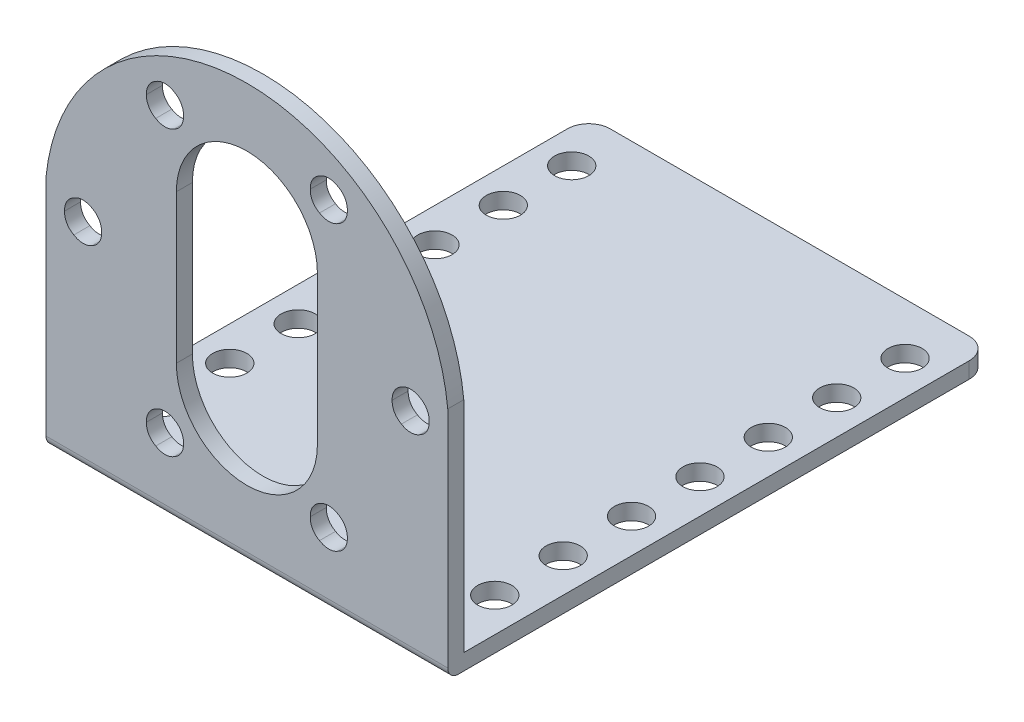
from build123d import *

# Parameters (mm, degrees)
BOSS_EXTRUDE1_DEPTH     = 1.5
SKETCH2_W               = 37.6
SKETCH2_H               = 50.8
BOSS_EXTRUDE2_DEPTH     = 1.5
FILLET1_R               = 1
FILLET2_R               = 2
CUT_EXTRUDE1_REACH      = 67.612
SKETCH3_R               = 1.6
LPATTERN1_COUNT         = 7
LPATTERN1_PITCH         = 6.4
MIRROR1_COPY_1_REACH    = 67.612
MIRROR1_COPY_1_SKETCH_R = 1.6
MIRROR1_COPY_2_REACH    = 67.612
MIRROR1_COPY_2_SKETCH_R = 1.6
MIRROR1_COPY_3_REACH    = 67.612
MIRROR1_COPY_3_SKETCH_R = 1.6
MIRROR1_COPY_4_REACH    = 67.612
MIRROR1_COPY_4_SKETCH_R = 1.6
MIRROR1_COPY_5_REACH    = 67.612
MIRROR1_COPY_5_SKETCH_R = 1.6
MIRROR1_COPY_6_REACH    = 67.612
MIRROR1_COPY_6_SKETCH_R = 1.6
CUT_EXTRUDE2_REACH      = 68.746
SKETCH4_R               = 1.6
CIRPATTERN1_COUNT       = 6


with BuildPart() as part:
    # Sketch1 → Boss-Extrude1 (new body)
    with BuildSketch(Plane.XY):
        with BuildLine():
            Line((-18.8, 0), (18.8, 0))
            Line((18.8, 0), (18.8, 22))
            ThreePointArc((18.8, 22), (0, 39), (-18.8, 22))
            Line((-18.8, 22), (-18.8, 0))
        make_face()
        with BuildLine():
            Line((-6.6, 12.999434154), (-6.6, 26.899434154))
            ThreePointArc((-6.6, 26.899434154), (0, 33.5), (6.6, 26.899434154))
            Line((6.6, 26.899434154), (6.6, 12.999434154))
            ThreePointArc((6.6, 12.999434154), (0, 6.399999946), (-6.6, 12.999434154))
        make_face(mode=Mode.SUBTRACT)
    extrude(amount=BOSS_EXTRUDE1_DEPTH)

    # Sketch2 → Boss-Extrude2 (add)
    with BuildSketch(Plane.XZ):
        with Locations((0, -23.9)):
            Rectangle(SKETCH2_W, SKETCH2_H)
    extrude(amount=-BOSS_EXTRUDE2_DEPTH)

    # Fillet1
    fillet1_edges = [part.edges().sort_by_distance(p)[0] for p in [
        (0, 0, 1.5),
    ]]
    fillet(fillet1_edges, radius=FILLET1_R)

    # Fillet2
    fillet2_edges = [part.edges().sort_by_distance(p)[0] for p in [
        (-18.8, 0.75, -49.3),
        (18.8, 0.75, -49.3),
    ]]
    fillet(fillet2_edges, radius=FILLET2_R)

    # Sketch3 → Cut-Extrude1 (cut, up to next)
    with BuildSketch(Plane.XZ, mode=Mode.PRIVATE) as cut_extrude1_sk1:
        with Locations((-15.6, -44.5)):
            Circle(SKETCH3_R)
    cut_extrude1_tool1 = extrude(cut_extrude1_sk1.sketch, amount=-CUT_EXTRUDE1_REACH, mode=Mode.PRIVATE) & part.part
    cut_extrude1 = cut_extrude1_tool1.solids().sort_by_distance((-15.6, 0, -44.5))[0]
    add(cut_extrude1, mode=Mode.SUBTRACT)

    # LPattern1: Cut-Extrude1 ×7
    with Locations(*[(0, 0, i * LPATTERN1_PITCH) for i in range(1, LPATTERN1_COUNT)]):
        add(cut_extrude1, mode=Mode.SUBTRACT)

    # Mirror1: Cut-Extrude1 across plane
    add(cut_extrude1.mirror(Plane(origin=(0, 0, 0), x_dir=(0, 0, 1), z_dir=(1, 0, 0))), mode=Mode.SUBTRACT)

    # Mirror1 copy 1 sketch → Mirror1 copy 1 (cut, up to next)
    with BuildSketch(Plane(origin=(0, 0, 6.4), x_dir=(-1, 0, 0), z_dir=(0, -1, 0)), mode=Mode.PRIVATE) as mirror1_copy_1_sk1:
        with Locations((-15.6, 44.5)):
            Circle(MIRROR1_COPY_1_SKETCH_R)
    mirror1_copy_1_tool1 = extrude(mirror1_copy_1_sk1.sketch, amount=-MIRROR1_COPY_1_REACH, mode=Mode.PRIVATE) & part.part
    add(mirror1_copy_1_tool1.solids().sort_by_distance((15.6, 0, -38.1))[0], mode=Mode.SUBTRACT)

    # Mirror1 copy 2 sketch → Mirror1 copy 2 (cut, up to next)
    with BuildSketch(Plane(origin=(0, 0, 12.8), x_dir=(-1, 0, 0), z_dir=(0, -1, 0)), mode=Mode.PRIVATE) as mirror1_copy_2_sk1:
        with Locations((-15.6, 44.5)):
            Circle(MIRROR1_COPY_2_SKETCH_R)
    mirror1_copy_2_tool1 = extrude(mirror1_copy_2_sk1.sketch, amount=-MIRROR1_COPY_2_REACH, mode=Mode.PRIVATE) & part.part
    add(mirror1_copy_2_tool1.solids().sort_by_distance((15.6, 0, -31.7))[0], mode=Mode.SUBTRACT)

    # Mirror1 copy 3 sketch → Mirror1 copy 3 (cut, up to next)
    with BuildSketch(Plane(origin=(0, 0, 19.2), x_dir=(-1, 0, 0), z_dir=(0, -1, 0)), mode=Mode.PRIVATE) as mirror1_copy_3_sk1:
        with Locations((-15.6, 44.5)):
            Circle(MIRROR1_COPY_3_SKETCH_R)
    mirror1_copy_3_tool1 = extrude(mirror1_copy_3_sk1.sketch, amount=-MIRROR1_COPY_3_REACH, mode=Mode.PRIVATE) & part.part
    add(mirror1_copy_3_tool1.solids().sort_by_distance((15.6, 0, -25.3))[0], mode=Mode.SUBTRACT)

    # Mirror1 copy 4 sketch → Mirror1 copy 4 (cut, up to next)
    with BuildSketch(Plane(origin=(0, 0, 25.6), x_dir=(-1, 0, 0), z_dir=(0, -1, 0)), mode=Mode.PRIVATE) as mirror1_copy_4_sk1:
        with Locations((-15.6, 44.5)):
            Circle(MIRROR1_COPY_4_SKETCH_R)
    mirror1_copy_4_tool1 = extrude(mirror1_copy_4_sk1.sketch, amount=-MIRROR1_COPY_4_REACH, mode=Mode.PRIVATE) & part.part
    add(mirror1_copy_4_tool1.solids().sort_by_distance((15.6, 0, -18.9))[0], mode=Mode.SUBTRACT)

    # Mirror1 copy 5 sketch → Mirror1 copy 5 (cut, up to next)
    with BuildSketch(Plane(origin=(0, 0, 32), x_dir=(-1, 0, 0), z_dir=(0, -1, 0)), mode=Mode.PRIVATE) as mirror1_copy_5_sk1:
        with Locations((-15.6, 44.5)):
            Circle(MIRROR1_COPY_5_SKETCH_R)
    mirror1_copy_5_tool1 = extrude(mirror1_copy_5_sk1.sketch, amount=-MIRROR1_COPY_5_REACH, mode=Mode.PRIVATE) & part.part
    add(mirror1_copy_5_tool1.solids().sort_by_distance((15.6, 0, -12.5))[0], mode=Mode.SUBTRACT)

    # Mirror1 copy 6 sketch → Mirror1 copy 6 (cut, up to next)
    with BuildSketch(Plane(origin=(0, 0, 38.4), x_dir=(-1, 0, 0), z_dir=(0, -1, 0)), mode=Mode.PRIVATE) as mirror1_copy_6_sk1:
        with Locations((-15.6, 44.5)):
            Circle(MIRROR1_COPY_6_SKETCH_R)
    mirror1_copy_6_tool1 = extrude(mirror1_copy_6_sk1.sketch, amount=-MIRROR1_COPY_6_REACH, mode=Mode.PRIVATE) & part.part
    add(mirror1_copy_6_tool1.solids().sort_by_distance((15.6, 0, -6.1))[0], mode=Mode.SUBTRACT)

    # Sketch4 → Cut-Extrude2 (cut, up to next)
    with BuildSketch(Plane.XY.offset(1.5), mode=Mode.PRIVATE) as cut_extrude2_sk1:
        with Locations((7.664771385, 33.22577344)):
            Circle(SKETCH4_R)
    cut_extrude2_tool1 = extrude(cut_extrude2_sk1.sketch, amount=-CUT_EXTRUDE2_REACH, mode=Mode.PRIVATE) & part.part
    # Sketch4 → Cut-Extrude2 (cut, up to next)
    with BuildSketch(Plane.XY.offset(1.5), mode=Mode.PRIVATE) as cut_extrude2_sk2:
        with Locations((15.32954277, 19.949999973)):
            Circle(SKETCH4_R)
    cut_extrude2_tool2 = extrude(cut_extrude2_sk2.sketch, amount=-CUT_EXTRUDE2_REACH, mode=Mode.PRIVATE) & part.part
    # Sketch4 → Cut-Extrude2 (cut, up to next)
    with BuildSketch(Plane.XY.offset(1.5), mode=Mode.PRIVATE) as cut_extrude2_sk3:
        with Locations((7.664771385, 6.674226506)):
            Circle(SKETCH4_R)
    cut_extrude2_tool3 = extrude(cut_extrude2_sk3.sketch, amount=-CUT_EXTRUDE2_REACH, mode=Mode.PRIVATE) & part.part
    # Sketch4 → Cut-Extrude2 (cut, up to next)
    with BuildSketch(Plane.XY.offset(1.5), mode=Mode.PRIVATE) as cut_extrude2_sk4:
        with Locations((-7.664771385, 6.674226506)):
            Circle(SKETCH4_R)
    cut_extrude2_tool4 = extrude(cut_extrude2_sk4.sketch, amount=-CUT_EXTRUDE2_REACH, mode=Mode.PRIVATE) & part.part
    # Sketch4 → Cut-Extrude2 (cut, up to next)
    with BuildSketch(Plane.XY.offset(1.5), mode=Mode.PRIVATE) as cut_extrude2_sk5:
        with Locations((-15.32954277, 19.949999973)):
            Circle(SKETCH4_R)
    cut_extrude2_tool5 = extrude(cut_extrude2_sk5.sketch, amount=-CUT_EXTRUDE2_REACH, mode=Mode.PRIVATE) & part.part
    # Sketch4 → Cut-Extrude2 (cut, up to next)
    with BuildSketch(Plane.XY.offset(1.5), mode=Mode.PRIVATE) as cut_extrude2_sk6:
        with Locations((-7.664771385, 33.22577344)):
            Circle(SKETCH4_R)
    cut_extrude2_tool6 = extrude(cut_extrude2_sk6.sketch, amount=-CUT_EXTRUDE2_REACH, mode=Mode.PRIVATE) & part.part
    cut_extrude2_1 = cut_extrude2_tool1.solids().sort_by_distance((7.664771, 33.225773, 1.5))[0]
    add(cut_extrude2_1, mode=Mode.SUBTRACT)
    cut_extrude2_2 = cut_extrude2_tool2.solids().sort_by_distance((15.329543, 19.95, 1.5))[0]
    add(cut_extrude2_2, mode=Mode.SUBTRACT)
    cut_extrude2_3 = cut_extrude2_tool3.solids().sort_by_distance((7.664771, 6.674227, 1.5))[0]
    add(cut_extrude2_3, mode=Mode.SUBTRACT)
    cut_extrude2_4 = cut_extrude2_tool4.solids().sort_by_distance((-7.664771, 6.674227, 1.5))[0]
    add(cut_extrude2_4, mode=Mode.SUBTRACT)
    cut_extrude2_5 = cut_extrude2_tool5.solids().sort_by_distance((-15.329543, 19.95, 1.5))[0]
    add(cut_extrude2_5, mode=Mode.SUBTRACT)
    cut_extrude2_6 = cut_extrude2_tool6.solids().sort_by_distance((-7.664771, 33.225773, 1.5))[0]
    add(cut_extrude2_6, mode=Mode.SUBTRACT)
    cut_extrude2 = cut_extrude2_1 + cut_extrude2_2 + cut_extrude2_3 + cut_extrude2_4 + cut_extrude2_5 + cut_extrude2_6  # Cut-Extrude2 as one shape, for the pattern or mirror that repeats it

    # CirPattern1: Cut-Extrude2 ×6 about axis
    cirpattern1_axis = Axis((0, 20.104705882, 0), (0, 0, 1))
    for i in range(1, CIRPATTERN1_COUNT):
        add(cut_extrude2.rotate(cirpattern1_axis, i * 360 / CIRPATTERN1_COUNT), mode=Mode.SUBTRACT)


solid = part.part
